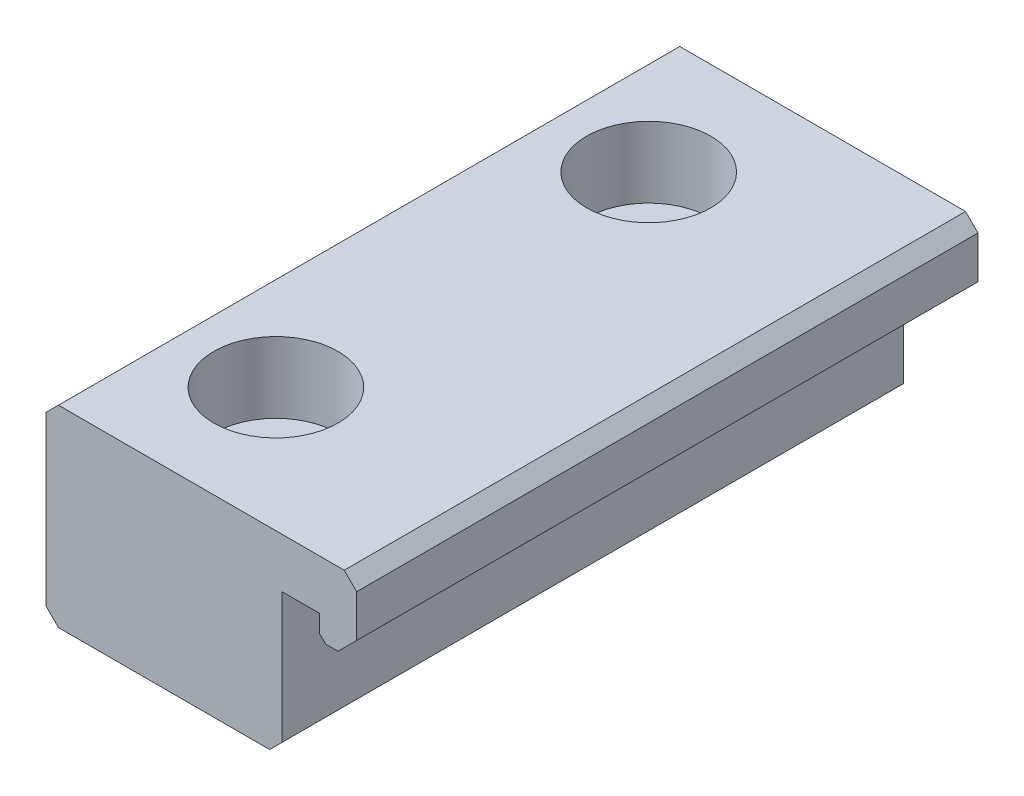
from build123d import *

# Parameters (mm, degrees)
EXTRUDE_1_DEPTH           = 50
CHAMFER_1_SIZE            = 1
CHAMFER_2_SIZE            = 0.5
CHAMFER_3_SIZE            = 1.5
HOLE_WIZARD_1_D           = 5.5
HOLE_WIZARD_1_CBORE_D     = 10
HOLE_WIZARD_1_CBORE_DEPTH = 5.7


with BuildPart() as part:
    # Sketch 1 → Extrude 1 (new body)
    with BuildSketch(Plane.XY):
        Polygon((12.5, 9.6), (15.5, 9.6), (15.5, 15.5), (-9.5, 15.5), (-9.5, 0), (9.5, 0), (9.5, 11.5), (12.5, 11.5), align=None)
    extrude(amount=EXTRUDE_1_DEPTH)

    # Chamfer 1
    chamfer_1_edges = [part.edges().sort_by_distance(p)[0] for p in [
        (9.5, 0, 25),
        (-9.5, 0, 25),
        (-9.5, 15.5, 25),
        (15.5, 15.5, 25),
    ]]
    chamfer(chamfer_1_edges, length=CHAMFER_1_SIZE)

    # Chamfer 2
    chamfer_2_edges = [part.edges().sort_by_distance(p)[0] for p in [
        (12.5, 9.6, 25),
    ]]
    chamfer(chamfer_2_edges, length=CHAMFER_2_SIZE)

    # Chamfer 3
    chamfer_3_edges = [part.edges().sort_by_distance(p)[0] for p in [
        (15.5, 9.6, 25),
    ]]
    chamfer(chamfer_3_edges, length=CHAMFER_3_SIZE)

    # Hole Wizard 1 (through all)
    with Locations(Plane(origin=(0, 15.5, 0), x_dir=(1, 0, 0), z_dir=(0, 1, 0))):
        with Locations((-1, -10), (-1, -40)):
            CounterBoreHole(HOLE_WIZARD_1_D / 2, HOLE_WIZARD_1_CBORE_D / 2, HOLE_WIZARD_1_CBORE_DEPTH)


solid = part.part
